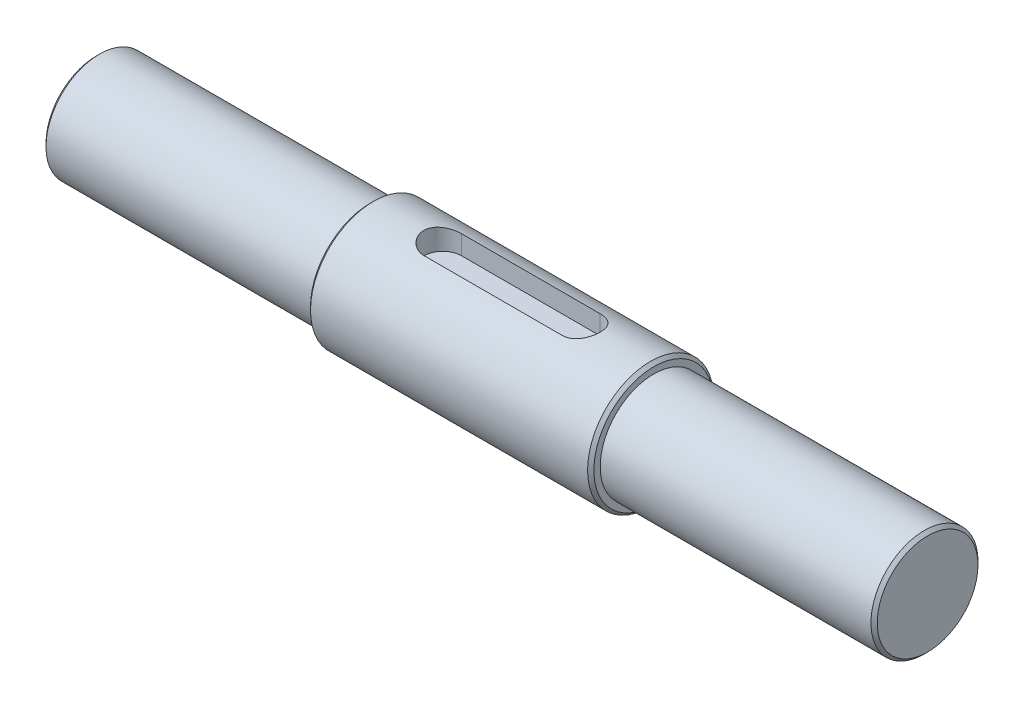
from build123d import *

# Parameters (mm, degrees)
SKETCH1_W           = 45
SKETCH1_H           = 10
SKETCH2_R           = 8.5
BOSS_EXTRUDE1_DEPTH = 43.5
BOSS_EXTRUDE2_START = 43.5
SKETCH3_R           = 8.5
BOSS_EXTRUDE2_DEPTH = 43.5
CHAMFER1_SIZE       = 0.5
CUT_EXTRUDE2_DEPTH  = 10


with BuildPart() as part:
    # Sketch1 → Revolve1 (revolve)
    with BuildSketch(Plane(origin=(0, 0, 0), x_dir=(-1, 0, 0), z_dir=(0, 0, -1)), mode=Mode.PRIVATE) as revolve1_sk:
        with Locations((-66, 5)):
            Rectangle(SKETCH1_W, SKETCH1_H)
    revolve(revolve1_sk.sketch.rotate(Axis((88.5, 0, 0), (-1, 0, 0)), 270), axis=Axis((88.5, 0, 0), (-1, 0, 0)))

    # Sketch2 → Boss-Extrude1 (add)
    with BuildSketch(Plane.ZY.offset(-43.5)):
        Circle(SKETCH2_R)
    extrude(amount=BOSS_EXTRUDE1_DEPTH)

    # Sketch3 → Boss-Extrude2 (add)
    with BuildSketch(Plane(origin=(88.5, 0, 0), x_dir=(0, 0, -1), z_dir=(1, 0, 0)).offset(BOSS_EXTRUDE2_START)):
        with Locations(Location((0, 0, 0), (0, 0, 180))):
            Circle(SKETCH3_R)
    extrude(amount=-BOSS_EXTRUDE2_DEPTH)

    # Chamfer1
    chamfer1_edges = [part.edges().sort_by_distance(p)[0] for p in [
        (0, 0, -8.5),
        (132, 0, -8.5),
        (43.5, 0, -10),
        (88.5, 0, -10),
    ]]
    chamfer(chamfer1_edges, length=CHAMFER1_SIZE)

    # Sketch4 → Cut-Extrude2 (cut)
    with BuildSketch(Plane.XZ.offset(-6.5)):
        with BuildLine():
            Line((77, 3), (55, 3))
            ThreePointArc((55, 3), (52, 0), (55, -3))
            Line((55, -3), (77, -3))
            ThreePointArc((77, -3), (80, 0), (77, 3))
        make_face()
    extrude(amount=-CUT_EXTRUDE2_DEPTH, mode=Mode.SUBTRACT)


solid = part.part
